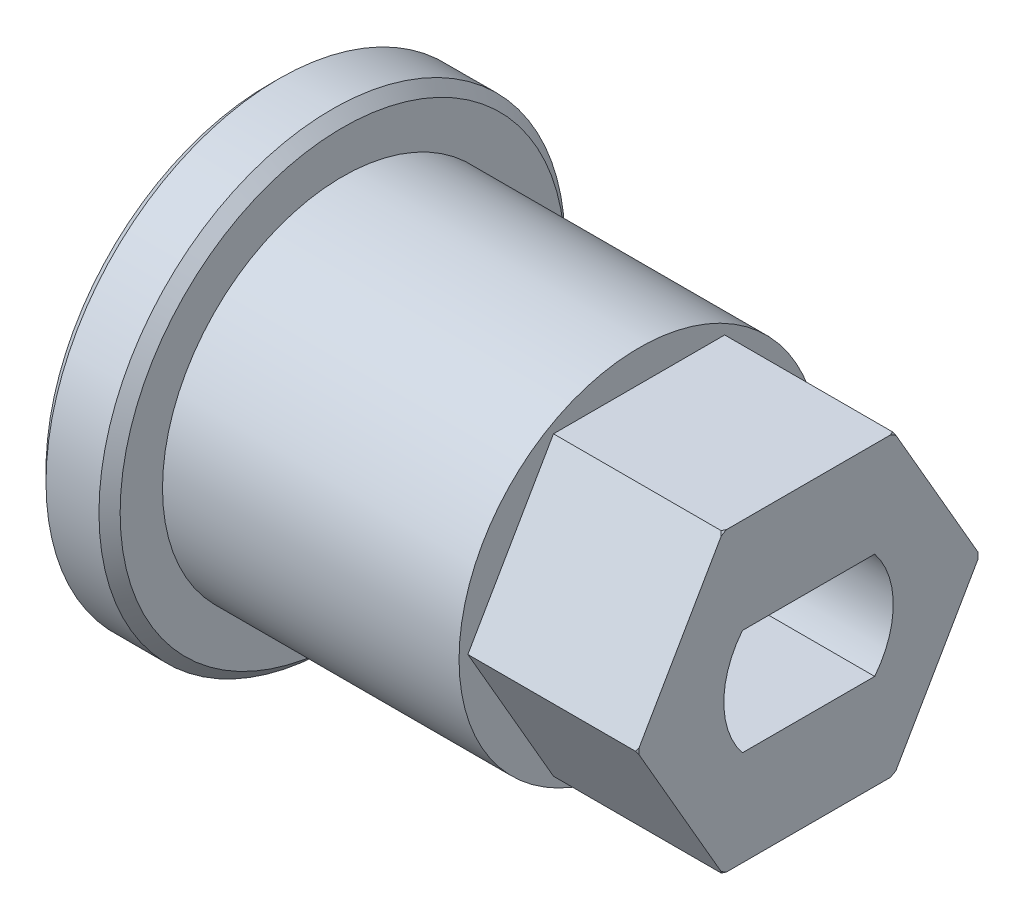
ISO-10303-21;
HEADER;
FILE_DESCRIPTION(('STEP AP214'),'2;1');
FILE_NAME('part.step','',(''),(''),'','','');
FILE_SCHEMA(('AUTOMOTIVE_DESIGN { 1 0 10303 214 1 1 1 1 }'));
ENDSEC;
DATA;
#1=APPLICATION_CONTEXT('core data for automotive mechanical design processes');
#2=APPLICATION_PROTOCOL_DEFINITION('international standard','automotive_design',2000,#1);
#3=PRODUCT_CONTEXT('',#1,'mechanical');
#4=PRODUCT('Part','Part','',(#3));
#5=PRODUCT_RELATED_PRODUCT_CATEGORY('part','',(#4));
#6=PRODUCT_DEFINITION_FORMATION('','',#4);
#7=PRODUCT_DEFINITION_CONTEXT('part definition',#1,'design');
#8=PRODUCT_DEFINITION('design','',#6,#7);
#9=PRODUCT_DEFINITION_SHAPE('','',#8);
#10=(LENGTH_UNIT() NAMED_UNIT(*) SI_UNIT(.MILLI.,.METRE.));
#11=(NAMED_UNIT(*) PLANE_ANGLE_UNIT() SI_UNIT($,.RADIAN.));
#12=(NAMED_UNIT(*) SI_UNIT($,.STERADIAN.) SOLID_ANGLE_UNIT());
#13=UNCERTAINTY_MEASURE_WITH_UNIT(LENGTH_MEASURE(1.E-05),#10,'distance_accuracy_value','');
#14=(GEOMETRIC_REPRESENTATION_CONTEXT(3) GLOBAL_UNCERTAINTY_ASSIGNED_CONTEXT((#13)) GLOBAL_UNIT_ASSIGNED_CONTEXT((#10,
#11,#12)) REPRESENTATION_CONTEXT('',''));
#15=CARTESIAN_POINT('',(0.,0.,0.));
#16=DIRECTION('',(0.,0.,1.));
#17=DIRECTION('',(1.,0.,0.));
#18=AXIS2_PLACEMENT_3D('',#15,#16,#17);
#19=CARTESIAN_POINT('',(0.,0.,0.));
#20=DIRECTION('',(-1.,0.,0.));
#21=DIRECTION('',(0.,0.,1.));
#22=AXIS2_PLACEMENT_3D('',#19,#20,#21);
#23=CYLINDRICAL_SURFACE('',#22,8.5);
#24=CARTESIAN_POINT('',(3.5,0.,0.));
#25=DIRECTION('',(-1.,0.,0.));
#26=DIRECTION('',(0.,0.,1.));
#27=AXIS2_PLACEMENT_3D('',#24,#25,#26);
#28=CIRCLE('',#27,8.5);
#29=CARTESIAN_POINT('',(3.5,0.,8.5));
#30=VERTEX_POINT('',#29);
#31=EDGE_CURVE('E221',#30,#30,#28,.T.);
#32=ORIENTED_EDGE('',*,*,#31,.F.);
#33=EDGE_LOOP('',(#32));
#34=FACE_BOUND('',#33,.T.);
#35=CARTESIAN_POINT('',(17.5,0.,0.));
#36=DIRECTION('',(1.,0.,0.));
#37=DIRECTION('',(0.,0.,-1.));
#38=AXIS2_PLACEMENT_3D('',#35,#36,#37);
#39=CIRCLE('',#38,8.5);
#40=CARTESIAN_POINT('',(17.5,0.,-8.5));
#41=VERTEX_POINT('',#40);
#42=EDGE_CURVE('E37',#41,#41,#39,.T.);
#43=ORIENTED_EDGE('',*,*,#42,.F.);
#44=EDGE_LOOP('',(#43));
#45=FACE_BOUND('',#44,.T.);
#46=ADVANCED_FACE('F33',(#34,#45),#23,.T.);
#47=CARTESIAN_POINT('',(25.5,8.5,0.));
#48=DIRECTION('',(-1.,0.,0.));
#49=DIRECTION('',(0.,0.,1.));
#50=AXIS2_PLACEMENT_3D('',#47,#48,#49);
#51=PLANE('',#50);
#52=DIRECTION('',(0.,0.,-1.));
#53=VECTOR('',#52,1.);
#54=CARTESIAN_POINT('',(25.5,-2.5,3.1224989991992));
#55=LINE('',#54,#53);
#56=CARTESIAN_POINT('',(25.5,-2.5,3.1224989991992));
#57=VERTEX_POINT('',#56);
#58=CARTESIAN_POINT('',(25.5,-2.5,-3.1224989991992));
#59=VERTEX_POINT('',#58);
#60=EDGE_CURVE('E199',#57,#59,#55,.T.);
#61=ORIENTED_EDGE('',*,*,#60,.F.);
#62=CARTESIAN_POINT('',(25.5,0.,0.));
#63=DIRECTION('',(1.,0.,0.));
#64=DIRECTION('',(0.,0.,-1.));
#65=AXIS2_PLACEMENT_3D('',#62,#63,#64);
#66=CIRCLE('',#65,4.);
#67=CARTESIAN_POINT('',(25.5,2.5,3.1224989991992));
#68=VERTEX_POINT('',#67);
#69=EDGE_CURVE('E197',#68,#57,#66,.T.);
#70=ORIENTED_EDGE('',*,*,#69,.F.);
#71=DIRECTION('',(0.,0.,1.));
#72=VECTOR('',#71,1.);
#73=CARTESIAN_POINT('',(25.5,2.5,3.1224989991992));
#74=LINE('',#73,#72);
#75=CARTESIAN_POINT('',(25.5,2.5,-3.1224989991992));
#76=VERTEX_POINT('',#75);
#77=EDGE_CURVE('E205',#76,#68,#74,.T.);
#78=ORIENTED_EDGE('',*,*,#77,.F.);
#79=CARTESIAN_POINT('',(25.5,0.,0.));
#80=DIRECTION('',(1.,0.,0.));
#81=DIRECTION('',(0.,0.,-1.));
#82=AXIS2_PLACEMENT_3D('',#79,#80,#81);
#83=CIRCLE('',#82,4.);
#84=EDGE_CURVE('E202',#59,#76,#83,.T.);
#85=ORIENTED_EDGE('',*,*,#84,.F.);
#86=EDGE_LOOP('',(#61,#70,#78,#85));
#87=FACE_BOUND('',#86,.T.);
#88=DIRECTION('',(0.,0.866025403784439,-0.5));
#89=VECTOR('',#88,1.);
#90=CARTESIAN_POINT('',(25.5,-7.,-4.04145188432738));
#91=LINE('',#90,#89);
#92=CARTESIAN_POINT('',(25.5,-6.85410196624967,-4.12568615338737));
#93=VERTEX_POINT('',#92);
#94=CARTESIAN_POINT('',(25.5,-0.145898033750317,-7.99866949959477));
#95=VERTEX_POINT('',#94);
#96=EDGE_CURVE('E383',#93,#95,#91,.T.);
#97=ORIENTED_EDGE('',*,*,#96,.T.);
#98=CARTESIAN_POINT('',(25.5,0.,0.));
#99=DIRECTION('',(-1.,0.,0.));
#100=DIRECTION('',(0.,0.,1.));
#101=AXIS2_PLACEMENT_3D('',#98,#99,#100);
#102=CIRCLE('',#101,7.99999999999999);
#103=CARTESIAN_POINT('',(25.5,0.145898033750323,-7.99866949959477));
#104=VERTEX_POINT('',#103);
#105=EDGE_CURVE('E362',#95,#104,#102,.F.);
#106=ORIENTED_EDGE('',*,*,#105,.T.);
#107=DIRECTION('',(0.,0.866025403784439,0.5));
#108=VECTOR('',#107,1.);
#109=CARTESIAN_POINT('',(25.5,0.,-8.08290376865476));
#110=LINE('',#109,#108);
#111=CARTESIAN_POINT('',(25.5,6.85410196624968,-4.12568615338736));
#112=VERTEX_POINT('',#111);
#113=EDGE_CURVE('E382',#104,#112,#110,.T.);
#114=ORIENTED_EDGE('',*,*,#113,.T.);
#115=CARTESIAN_POINT('',(25.5,7.,-3.8729833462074));
#116=VERTEX_POINT('',#115);
#117=EDGE_CURVE('E364',#112,#116,#102,.F.);
#118=ORIENTED_EDGE('',*,*,#117,.T.);
#119=DIRECTION('',(0.,0.,1.));
#120=VECTOR('',#119,1.);
#121=CARTESIAN_POINT('',(25.5,7.,-4.04145188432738));
#122=LINE('',#121,#120);
#123=CARTESIAN_POINT('',(25.5,7.,3.8729833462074));
#124=VERTEX_POINT('',#123);
#125=EDGE_CURVE('E375',#116,#124,#122,.T.);
#126=ORIENTED_EDGE('',*,*,#125,.T.);
#127=CARTESIAN_POINT('',(25.5,6.85410196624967,4.12568615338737));
#128=VERTEX_POINT('',#127);
#129=EDGE_CURVE('E233',#124,#128,#102,.F.);
#130=ORIENTED_EDGE('',*,*,#129,.T.);
#131=DIRECTION('',(0.,-0.866025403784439,0.5));
#132=VECTOR('',#131,1.);
#133=CARTESIAN_POINT('',(25.5,7.,4.04145188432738));
#134=LINE('',#133,#132);
#135=CARTESIAN_POINT('',(25.5,0.145898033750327,7.99866949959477));
#136=VERTEX_POINT('',#135);
#137=EDGE_CURVE('E373',#128,#136,#134,.T.);
#138=ORIENTED_EDGE('',*,*,#137,.T.);
#139=CARTESIAN_POINT('',(25.5,-0.14589803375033,7.99866949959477));
#140=VERTEX_POINT('',#139);
#141=EDGE_CURVE('E230',#136,#140,#102,.F.);
#142=ORIENTED_EDGE('',*,*,#141,.T.);
#143=DIRECTION('',(0.,-0.866025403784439,-0.5));
#144=VECTOR('',#143,1.);
#145=CARTESIAN_POINT('',(25.5,0.,8.08290376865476));
#146=LINE('',#145,#144);
#147=CARTESIAN_POINT('',(25.5,-6.85410196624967,4.12568615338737));
#148=VERTEX_POINT('',#147);
#149=EDGE_CURVE('E174',#140,#148,#146,.T.);
#150=ORIENTED_EDGE('',*,*,#149,.T.);
#151=CARTESIAN_POINT('',(25.5,-7.,3.8729833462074));
#152=VERTEX_POINT('',#151);
#153=EDGE_CURVE('E234',#148,#152,#102,.F.);
#154=ORIENTED_EDGE('',*,*,#153,.T.);
#155=DIRECTION('',(0.,0.,-1.));
#156=VECTOR('',#155,1.);
#157=CARTESIAN_POINT('',(25.5,-7.,4.04145188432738));
#158=LINE('',#157,#156);
#159=CARTESIAN_POINT('',(25.5,-7.,-3.8729833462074));
#160=VERTEX_POINT('',#159);
#161=EDGE_CURVE('E171',#152,#160,#158,.T.);
#162=ORIENTED_EDGE('',*,*,#161,.T.);
#163=EDGE_CURVE('E353',#160,#93,#102,.F.);
#164=ORIENTED_EDGE('',*,*,#163,.T.);
#165=EDGE_LOOP('',(#97,#106,#114,#118,#126,#130,#138,#142,#150,#154,#162,#164));
#166=FACE_BOUND('',#165,.T.);
#167=ADVANCED_FACE('F358',(#87,#166),#51,.F.);
#168=CARTESIAN_POINT('',(25.,0.,0.));
#169=DIRECTION('',(-1.,0.,0.));
#170=DIRECTION('',(0.,0.,1.));
#171=AXIS2_PLACEMENT_3D('',#168,#169,#170);
#172=CONICAL_SURFACE('',#171,8.5,0.785398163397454);
#173=CARTESIAN_POINT('',(26.4953331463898,-7.,-0.255651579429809));
#174=CARTESIAN_POINT('',(26.4913094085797,-7.,-0.366254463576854));
#175=CARTESIAN_POINT('',(26.4846476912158,-7.,-0.476753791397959));
#176=CARTESIAN_POINT('',(26.466209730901,-7.,-0.697302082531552));
#177=CARTESIAN_POINT('',(26.4544345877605,-7.,-0.807351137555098));
#178=CARTESIAN_POINT('',(26.4259523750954,-7.,-1.02662605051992));
#179=CARTESIAN_POINT('',(26.4092533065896,-7.,-1.13585295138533));
#180=CARTESIAN_POINT('',(26.371155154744,-7.,-1.35348100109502));
#181=CARTESIAN_POINT('',(26.3497558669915,-7.,-1.46188211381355));
#182=CARTESIAN_POINT('',(26.2794364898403,-7.,-1.78321744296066));
#183=CARTESIAN_POINT('',(26.2240612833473,-7.,-1.99475997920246));
#184=CARTESIAN_POINT('',(26.0983710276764,-7.,-2.41330005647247));
#185=CARTESIAN_POINT('',(26.0280552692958,-7.,-2.62029738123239));
#186=CARTESIAN_POINT('',(25.9251730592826,-7.,-2.89521230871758));
#187=CARTESIAN_POINT('',(25.8981218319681,-7.,-2.9652407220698));
#188=CARTESIAN_POINT('',(25.8425913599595,-7.,-3.10483620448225));
#189=CARTESIAN_POINT('',(25.8141102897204,-7.,-3.17440254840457));
#190=CARTESIAN_POINT('',(25.6453013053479,-7.,-3.57592869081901));
#191=CARTESIAN_POINT('',(25.4906404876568,-7.,-3.90192619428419));
#192=CARTESIAN_POINT('',(25.1596349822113,-7.,-4.54280544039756));
#193=CARTESIAN_POINT('',(24.9832701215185,-7.,-4.85767648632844));
#194=CARTESIAN_POINT('',(24.6139806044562,-7.,-5.47942576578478));
#195=CARTESIAN_POINT('',(24.4209841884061,-7.,-5.78626106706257));
#196=CARTESIAN_POINT('',(24.023365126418,-7.,-6.39208744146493));
#197=CARTESIAN_POINT('',(23.8187464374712,-7.,-6.69108113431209));
#198=CARTESIAN_POINT('',(23.4058243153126,-7.,-7.27558025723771));
#199=CARTESIAN_POINT('',(23.1977335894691,-7.,-7.56123671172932));
#200=CARTESIAN_POINT('',(22.7750502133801,-7.,-8.12773460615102));
#201=CARTESIAN_POINT('',(22.5604567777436,-7.,-8.40857545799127));
#202=CARTESIAN_POINT('',(22.128567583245,-7.,-8.96323031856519));
#203=CARTESIAN_POINT('',(21.9113272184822,-7.,-9.23708760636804));
#204=CARTESIAN_POINT('',(21.47287781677,-7.,-9.78147627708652));
#205=CARTESIAN_POINT('',(21.2516699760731,-7.,-10.0520086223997));
#206=CARTESIAN_POINT('',(21.0289148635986,-7.,-10.3212385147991));
#207=B_SPLINE_CURVE_WITH_KNOTS('',3,(#173,#174,#175,#176,#177,#178,#179,#180,#181,#182,#183,
#184,#185,#186,#187,#188,#189,#190,#191,#192,#193,#194,#195,#196,#197,#198,#199,#200,#201,#202,
#203,#204,#205,#206),.UNSPECIFIED.,.F.,.F.,(4,2,2,2,2,2,2,2,2,2,2,2,2,2,2,2,4),(0.,
0.331985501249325,0.663899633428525,0.995277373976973,1.3266695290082,1.98198161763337,
2.63732481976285,2.86253012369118,3.08803065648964,4.16917769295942,5.25133730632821,
6.33842536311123,7.42514549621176,8.48527200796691,9.54552707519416,10.5941618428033,
11.6424855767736),.UNSPECIFIED.);
#208=CARTESIAN_POINT('',(25.4170962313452,-7.,-4.04145188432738));
#209=VERTEX_POINT('',#208);
#210=EDGE_CURVE('E42',#160,#209,#207,.T.);
#211=ORIENTED_EDGE('',*,*,#210,.T.);
#212=CARTESIAN_POINT('',(25.4169807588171,-7.0002,-4.04133641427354));
#213=CARTESIAN_POINT('',(25.4310314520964,-6.97586775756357,-4.0553846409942));
#214=CARTESIAN_POINT('',(25.4449917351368,-6.95149698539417,-4.06945511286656));
#215=CARTESIAN_POINT('',(25.4727314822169,-6.90267837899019,-4.09764054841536));
#216=CARTESIAN_POINT('',(25.4865109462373,-6.87823054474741,-4.11175551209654));
#217=CARTESIAN_POINT('',(25.5001999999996,-6.85374418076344,-4.12589272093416));
#218=B_SPLINE_CURVE_WITH_KNOTS('',3,(#212,#213,#214,#215,#216,#217),.UNSPECIFIED.,.F.,.F.,(4,2,
4),(0.,0.0942402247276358,0.188480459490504),.UNSPECIFIED.);
#219=EDGE_CURVE('E11',#209,#93,#218,.T.);
#220=ORIENTED_EDGE('',*,*,#219,.T.);
#221=ORIENTED_EDGE('',*,*,#163,.F.);
#222=EDGE_LOOP('',(#211,#220,#221));
#223=FACE_BOUND('',#222,.T.);
#224=ADVANCED_FACE('F263',(#223),#172,.T.);
#225=CARTESIAN_POINT('',(25.5001999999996,-6.85374418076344,4.12589272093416));
#226=CARTESIAN_POINT('',(25.4865109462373,-6.87823054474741,4.11175551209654));
#227=CARTESIAN_POINT('',(25.4727314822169,-6.90267837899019,4.09764054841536));
#228=CARTESIAN_POINT('',(25.4449917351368,-6.95149698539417,4.06945511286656));
#229=CARTESIAN_POINT('',(25.4310314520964,-6.97586775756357,4.0553846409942));
#230=CARTESIAN_POINT('',(25.4169807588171,-7.0002,4.04133641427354));
#231=B_SPLINE_CURVE_WITH_KNOTS('',3,(#225,#226,#227,#228,#229,#230),.UNSPECIFIED.,.F.,.F.,(4,2,
4),(0.,0.0942402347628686,0.188480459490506),.UNSPECIFIED.);
#232=CARTESIAN_POINT('',(25.4170962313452,-7.,4.04145188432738));
#233=VERTEX_POINT('',#232);
#234=EDGE_CURVE('E327',#148,#233,#231,.T.);
#235=ORIENTED_EDGE('',*,*,#234,.T.);
#236=CARTESIAN_POINT('',(21.0289148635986,-7.,10.3212385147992));
#237=CARTESIAN_POINT('',(21.1445806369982,-7.,10.1814771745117));
#238=CARTESIAN_POINT('',(21.2598103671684,-7.,10.0413551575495));
#239=CARTESIAN_POINT('',(21.4892937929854,-7.,9.76031015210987));
#240=CARTESIAN_POINT('',(21.6035474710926,-7.,9.61938714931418));
#241=CARTESIAN_POINT('',(21.9447566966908,-7.,9.19521227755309));
#242=CARTESIAN_POINT('',(22.170084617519,-7.,8.9106458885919));
#243=CARTESIAN_POINT('',(22.6178186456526,-7.,8.33398359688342));
#244=CARTESIAN_POINT('',(22.840161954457,-7.,8.04183881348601));
#245=CARTESIAN_POINT('',(23.277636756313,-7.,7.45223523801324));
#246=CARTESIAN_POINT('',(23.4927692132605,-7.,7.15477716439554));
#247=CARTESIAN_POINT('',(23.9030423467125,-7.,6.56835365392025));
#248=CARTESIAN_POINT('',(24.098644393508,-7.,6.27971248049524));
#249=CARTESIAN_POINT('',(24.4787075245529,-7.,5.69500932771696));
#250=CARTESIAN_POINT('',(24.6631654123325,-7.,5.39894525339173));
#251=CARTESIAN_POINT('',(25.0162917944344,-7.,4.79915277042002));
#252=CARTESIAN_POINT('',(25.1850232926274,-7.,4.49546173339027));
#253=CARTESIAN_POINT('',(25.5021152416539,-7.,3.87767682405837));
#254=CARTESIAN_POINT('',(25.6504911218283,-7.,3.56359105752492));
#255=CARTESIAN_POINT('',(25.8344137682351,-7.,3.12610655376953));
#256=CARTESIAN_POINT('',(25.8819733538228,-7.,3.0077306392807));
#257=CARTESIAN_POINT('',(25.9728930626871,-7.,2.76938553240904));
#258=CARTESIAN_POINT('',(26.0162532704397,-7.,2.64941637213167));
#259=CARTESIAN_POINT('',(26.1392888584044,-7.,2.28725458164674));
#260=CARTESIAN_POINT('',(26.2120069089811,-7.,2.04260287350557));
#261=CARTESIAN_POINT('',(26.3047182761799,-7.,1.66941558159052));
#262=CARTESIAN_POINT('',(26.3330587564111,-7.,1.54291250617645));
#263=CARTESIAN_POINT('',(26.383461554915,-7.,1.28865808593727));
#264=CARTESIAN_POINT('',(26.4055244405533,-7.,1.16090685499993));
#265=CARTESIAN_POINT('',(26.4430226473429,-7.,0.903946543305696));
#266=CARTESIAN_POINT('',(26.4584330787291,-7.,0.774733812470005));
#267=CARTESIAN_POINT('',(26.4822284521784,-7.,0.515614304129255));
#268=CARTESIAN_POINT('',(26.4906106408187,-7.,0.385707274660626));
#269=CARTESIAN_POINT('',(26.4953331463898,-7.,0.255651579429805));
#270=B_SPLINE_CURVE_WITH_KNOTS('',3,(#236,#237,#238,#239,#240,#241,#242,#243,#244,#245,#246,
#247,#248,#249,#250,#251,#252,#253,#254,#255,#256,#257,#258,#259,#260,#261,#262,#263,#264,#265,
#266,#267,#268,#269),.UNSPECIFIED.,.F.,.F.,(4,2,2,2,2,2,2,2,2,2,2,2,2,2,2,2,4),(0.,
0.544246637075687,1.08850303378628,2.17737192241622,3.27868175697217,4.37984378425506,
5.42567662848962,6.47180803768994,7.51354993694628,8.55449779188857,8.93714490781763,
9.31978432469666,10.0843963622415,10.4731860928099,10.8619406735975,11.252137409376,
11.642486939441),.UNSPECIFIED.);
#271=EDGE_CURVE('E334',#233,#152,#270,.T.);
#272=ORIENTED_EDGE('',*,*,#271,.T.);
#273=ORIENTED_EDGE('',*,*,#153,.F.);
#274=EDGE_LOOP('',(#235,#272,#273));
#275=FACE_BOUND('',#274,.T.);
#276=ADVANCED_FACE('F519',(#275),#172,.T.);
#277=CARTESIAN_POINT('',(25.5002,0.146255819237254,7.99846293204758));
#278=CARTESIAN_POINT('',(25.4865109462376,0.121769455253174,8.01260014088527));
#279=CARTESIAN_POINT('',(25.4727314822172,0.0973216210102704,8.02671510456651));
#280=CARTESIAN_POINT('',(25.4449917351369,0.0485030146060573,8.05490054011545));
#281=CARTESIAN_POINT('',(25.4310314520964,0.0241322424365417,8.06897101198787));
#282=CARTESIAN_POINT('',(25.4169807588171,-0.00020000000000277,8.0830192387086));
#283=B_SPLINE_CURVE_WITH_KNOTS('',3,(#277,#278,#279,#280,#281,#282),.UNSPECIFIED.,.F.,.F.,(4,2,
4),(0.,0.0942402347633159,0.188480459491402),.UNSPECIFIED.);
#284=CARTESIAN_POINT('',(25.4170962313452,0.,8.08290376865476));
#285=VERTEX_POINT('',#284);
#286=EDGE_CURVE('E301',#136,#285,#283,.T.);
#287=ORIENTED_EDGE('',*,*,#286,.T.);
#288=CARTESIAN_POINT('',(25.4169807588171,0.000199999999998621,8.0830192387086));
#289=CARTESIAN_POINT('',(25.4310314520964,-0.0241322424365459,8.06897101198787));
#290=CARTESIAN_POINT('',(25.4449917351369,-0.0485030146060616,8.05490054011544));
#291=CARTESIAN_POINT('',(25.4727314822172,-0.0973216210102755,8.02671510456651));
#292=CARTESIAN_POINT('',(25.4865109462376,-0.121769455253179,8.01260014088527));
#293=CARTESIAN_POINT('',(25.5002,-0.14625581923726,7.99846293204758));
#294=B_SPLINE_CURVE_WITH_KNOTS('',3,(#288,#289,#290,#291,#292,#293),.UNSPECIFIED.,.F.,.F.,(4,2,
4),(0.,0.0942402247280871,0.188480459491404),.UNSPECIFIED.);
#295=EDGE_CURVE('E321',#285,#140,#294,.T.);
#296=ORIENTED_EDGE('',*,*,#295,.T.);
#297=ORIENTED_EDGE('',*,*,#141,.F.);
#298=EDGE_LOOP('',(#287,#296,#297));
#299=FACE_BOUND('',#298,.T.);
#300=ADVANCED_FACE('F395',(#299),#172,.T.);
#301=CARTESIAN_POINT('',(26.4953331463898,7.,0.255651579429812));
#302=CARTESIAN_POINT('',(26.4913094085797,7.,0.366254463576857));
#303=CARTESIAN_POINT('',(26.4846476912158,7.,0.476753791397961));
#304=CARTESIAN_POINT('',(26.466209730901,7.,0.697302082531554));
#305=CARTESIAN_POINT('',(26.4544345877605,7.,0.807351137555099));
#306=CARTESIAN_POINT('',(26.4259523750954,7.,1.02662605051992));
#307=CARTESIAN_POINT('',(26.4092533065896,7.,1.13585295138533));
#308=CARTESIAN_POINT('',(26.371155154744,7.,1.35348100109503));
#309=CARTESIAN_POINT('',(26.3497558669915,7.,1.46188211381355));
#310=CARTESIAN_POINT('',(26.2794364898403,7.,1.78321744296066));
#311=CARTESIAN_POINT('',(26.2240612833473,7.,1.99475997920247));
#312=CARTESIAN_POINT('',(26.0983710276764,7.,2.41330005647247));
#313=CARTESIAN_POINT('',(26.0280552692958,7.,2.62029738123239));
#314=CARTESIAN_POINT('',(25.9251730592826,7.,2.89521230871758));
#315=CARTESIAN_POINT('',(25.8981218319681,7.,2.9652407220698));
#316=CARTESIAN_POINT('',(25.8425913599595,7.,3.10483620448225));
#317=CARTESIAN_POINT('',(25.8141102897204,7.,3.17440254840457));
#318=CARTESIAN_POINT('',(25.6453013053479,7.,3.57592869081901));
#319=CARTESIAN_POINT('',(25.4906404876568,7.,3.90192619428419));
#320=CARTESIAN_POINT('',(25.1596349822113,7.,4.54280544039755));
#321=CARTESIAN_POINT('',(24.9832701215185,7.,4.85767648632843));
#322=CARTESIAN_POINT('',(24.6139806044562,7.,5.47942576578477));
#323=CARTESIAN_POINT('',(24.4209841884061,7.,5.78626106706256));
#324=CARTESIAN_POINT('',(24.023365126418,7.,6.39208744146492));
#325=CARTESIAN_POINT('',(23.8187464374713,7.,6.69108113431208));
#326=CARTESIAN_POINT('',(23.4058243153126,7.,7.27558025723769));
#327=CARTESIAN_POINT('',(23.1977335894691,7.,7.56123671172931));
#328=CARTESIAN_POINT('',(22.7750502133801,7.,8.12773460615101));
#329=CARTESIAN_POINT('',(22.5604567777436,7.,8.40857545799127));
#330=CARTESIAN_POINT('',(22.128567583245,7.,8.96323031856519));
#331=CARTESIAN_POINT('',(21.9113272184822,7.,9.23708760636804));
#332=CARTESIAN_POINT('',(21.47287781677,7.,9.78147627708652));
#333=CARTESIAN_POINT('',(21.2516699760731,7.,10.0520086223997));
#334=CARTESIAN_POINT('',(21.0289148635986,7.,10.3212385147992));
#335=B_SPLINE_CURVE_WITH_KNOTS('',3,(#301,#302,#303,#304,#305,#306,#307,#308,#309,#310,#311,
#312,#313,#314,#315,#316,#317,#318,#319,#320,#321,#322,#323,#324,#325,#326,#327,#328,#329,#330,
#331,#332,#333,#334),.UNSPECIFIED.,.F.,.F.,(4,2,2,2,2,2,2,2,2,2,2,2,2,2,2,2,4),(0.,
0.331985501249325,0.663899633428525,0.995277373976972,1.3266695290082,1.98198161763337,
2.63732481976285,2.86253012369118,3.08803065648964,4.16917769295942,5.2513373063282,
6.33842536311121,7.42514549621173,8.4852720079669,9.54552707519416,10.5941618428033,
11.6424855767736),.UNSPECIFIED.);
#336=CARTESIAN_POINT('',(25.4170962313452,7.,4.04145188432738));
#337=VERTEX_POINT('',#336);
#338=EDGE_CURVE('E287',#124,#337,#335,.T.);
#339=ORIENTED_EDGE('',*,*,#338,.T.);
#340=CARTESIAN_POINT('',(25.4169807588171,7.0002,4.04133641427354));
#341=CARTESIAN_POINT('',(25.4310314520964,6.97586775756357,4.0553846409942));
#342=CARTESIAN_POINT('',(25.4449917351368,6.95149698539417,4.06945511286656));
#343=CARTESIAN_POINT('',(25.4727314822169,6.90267837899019,4.09764054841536));
#344=CARTESIAN_POINT('',(25.4865109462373,6.87823054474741,4.11175551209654));
#345=CARTESIAN_POINT('',(25.5001999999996,6.85374418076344,4.12589272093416));
#346=B_SPLINE_CURVE_WITH_KNOTS('',3,(#340,#341,#342,#343,#344,#345),.UNSPECIFIED.,.F.,.F.,(4,2,
4),(0.,0.0942402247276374,0.188480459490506),.UNSPECIFIED.);
#347=EDGE_CURVE('E294',#337,#128,#346,.T.);
#348=ORIENTED_EDGE('',*,*,#347,.T.);
#349=ORIENTED_EDGE('',*,*,#129,.F.);
#350=EDGE_LOOP('',(#339,#348,#349));
#351=FACE_BOUND('',#350,.T.);
#352=ADVANCED_FACE('F377',(#351),#172,.T.);
#353=ORIENTED_EDGE('',*,*,#105,.F.);
#354=CARTESIAN_POINT('',(25.5002,-0.14625581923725,-7.99846293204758));
#355=CARTESIAN_POINT('',(25.4865109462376,-0.12176945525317,-8.01260014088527));
#356=CARTESIAN_POINT('',(25.4727314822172,-0.0973216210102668,-8.02671510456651));
#357=CARTESIAN_POINT('',(25.4449917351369,-0.0485030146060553,-8.05490054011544));
#358=CARTESIAN_POINT('',(25.4310314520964,-0.024132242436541,-8.06897101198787));
#359=CARTESIAN_POINT('',(25.4169807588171,0.000200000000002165,-8.0830192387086));
#360=B_SPLINE_CURVE_WITH_KNOTS('',3,(#354,#355,#356,#357,#358,#359),.UNSPECIFIED.,.F.,.F.,(4,2,
4),(0.,0.0942402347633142,0.188480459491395),.UNSPECIFIED.);
#361=CARTESIAN_POINT('',(25.4170962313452,0.,-8.08290376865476));
#362=VERTEX_POINT('',#361);
#363=EDGE_CURVE('E281',#95,#362,#360,.T.);
#364=ORIENTED_EDGE('',*,*,#363,.T.);
#365=CARTESIAN_POINT('',(25.4169807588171,-0.000199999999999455,-8.0830192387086));
#366=CARTESIAN_POINT('',(25.4310314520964,0.0241322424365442,-8.06897101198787));
#367=CARTESIAN_POINT('',(25.4449917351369,0.0485030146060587,-8.05490054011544));
#368=CARTESIAN_POINT('',(25.4727314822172,0.0973216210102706,-8.02671510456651));
#369=CARTESIAN_POINT('',(25.4865109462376,0.121769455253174,-8.01260014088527));
#370=CARTESIAN_POINT('',(25.5002,0.146255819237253,-7.99846293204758));
#371=B_SPLINE_CURVE_WITH_KNOTS('',3,(#365,#366,#367,#368,#369,#370),.UNSPECIFIED.,.F.,.F.,(4,2,
4),(0.,0.0942402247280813,0.188480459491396),.UNSPECIFIED.);
#372=EDGE_CURVE('E151',#362,#104,#371,.T.);
#373=ORIENTED_EDGE('',*,*,#372,.T.);
#374=EDGE_LOOP('',(#353,#364,#373));
#375=FACE_BOUND('',#374,.T.);
#376=ADVANCED_FACE('F389',(#375),#172,.T.);
#377=CARTESIAN_POINT('',(25.5001999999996,6.85374418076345,-4.12589272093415));
#378=CARTESIAN_POINT('',(25.4865109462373,6.87823054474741,-4.11175551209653));
#379=CARTESIAN_POINT('',(25.4727314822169,6.90267837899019,-4.09764054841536));
#380=CARTESIAN_POINT('',(25.4449917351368,6.95149698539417,-4.06945511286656));
#381=CARTESIAN_POINT('',(25.4310314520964,6.97586775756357,-4.0553846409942));
#382=CARTESIAN_POINT('',(25.4169807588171,7.0002,-4.04133641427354));
#383=B_SPLINE_CURVE_WITH_KNOTS('',3,(#377,#378,#379,#380,#381,#382),.UNSPECIFIED.,.F.,.F.,(4,2,
4),(0.,0.0942402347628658,0.188480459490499),.UNSPECIFIED.);
#384=CARTESIAN_POINT('',(25.4170962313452,7.,-4.04145188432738));
#385=VERTEX_POINT('',#384);
#386=EDGE_CURVE('E247',#112,#385,#383,.T.);
#387=ORIENTED_EDGE('',*,*,#386,.T.);
#388=CARTESIAN_POINT('',(21.0289148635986,7.,-10.3212385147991));
#389=CARTESIAN_POINT('',(21.1445806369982,7.,-10.1814771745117));
#390=CARTESIAN_POINT('',(21.2598103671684,7.,-10.0413551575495));
#391=CARTESIAN_POINT('',(21.4892937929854,7.,-9.76031015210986));
#392=CARTESIAN_POINT('',(21.6035474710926,7.,-9.61938714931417));
#393=CARTESIAN_POINT('',(21.9447566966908,7.,-9.19521227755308));
#394=CARTESIAN_POINT('',(22.170084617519,7.,-8.91064588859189));
#395=CARTESIAN_POINT('',(22.6178186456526,7.,-8.33398359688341));
#396=CARTESIAN_POINT('',(22.840161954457,7.,-8.041838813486));
#397=CARTESIAN_POINT('',(23.277636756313,7.,-7.45223523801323));
#398=CARTESIAN_POINT('',(23.4927692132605,7.,-7.15477716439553));
#399=CARTESIAN_POINT('',(23.9030423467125,7.,-6.56835365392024));
#400=CARTESIAN_POINT('',(24.098644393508,7.,-6.27971248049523));
#401=CARTESIAN_POINT('',(24.4787075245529,7.,-5.69500932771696));
#402=CARTESIAN_POINT('',(24.6631654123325,7.,-5.39894525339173));
#403=CARTESIAN_POINT('',(25.0162917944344,7.,-4.79915277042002));
#404=CARTESIAN_POINT('',(25.1850232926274,7.,-4.49546173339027));
#405=CARTESIAN_POINT('',(25.5021152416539,7.,-3.87767682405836));
#406=CARTESIAN_POINT('',(25.6504911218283,7.,-3.56359105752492));
#407=CARTESIAN_POINT('',(25.8344137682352,7.,-3.12610655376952));
#408=CARTESIAN_POINT('',(25.8819733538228,7.,-3.0077306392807));
#409=CARTESIAN_POINT('',(25.9728930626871,7.,-2.76938553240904));
#410=CARTESIAN_POINT('',(26.0162532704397,7.,-2.64941637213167));
#411=CARTESIAN_POINT('',(26.1392888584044,7.,-2.28725458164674));
#412=CARTESIAN_POINT('',(26.2120069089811,7.,-2.04260287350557));
#413=CARTESIAN_POINT('',(26.3047182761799,7.,-1.66941558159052));
#414=CARTESIAN_POINT('',(26.3330587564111,7.,-1.54291250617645));
#415=CARTESIAN_POINT('',(26.383461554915,7.,-1.28865808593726));
#416=CARTESIAN_POINT('',(26.4055244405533,7.,-1.16090685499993));
#417=CARTESIAN_POINT('',(26.4430226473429,7.,-0.903946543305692));
#418=CARTESIAN_POINT('',(26.4584330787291,7.,-0.774733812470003));
#419=CARTESIAN_POINT('',(26.4822284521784,7.,-0.515614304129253));
#420=CARTESIAN_POINT('',(26.4906106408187,7.,-0.385707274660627));
#421=CARTESIAN_POINT('',(26.4953331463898,7.,-0.255651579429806));
#422=B_SPLINE_CURVE_WITH_KNOTS('',3,(#388,#389,#390,#391,#392,#393,#394,#395,#396,#397,#398,
#399,#400,#401,#402,#403,#404,#405,#406,#407,#408,#409,#410,#411,#412,#413,#414,#415,#416,#417,
#418,#419,#420,#421),.UNSPECIFIED.,.F.,.F.,(4,2,2,2,2,2,2,2,2,2,2,2,2,2,2,2,4),(0.,
0.544246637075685,1.08850303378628,2.17737192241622,3.27868175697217,4.37984378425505,
5.42567662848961,6.47180803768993,7.51354993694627,8.55449779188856,8.93714490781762,
9.31978432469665,10.0843963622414,10.4731860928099,10.8619406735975,11.252137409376,
11.642486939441),.UNSPECIFIED.);
#423=EDGE_CURVE('E256',#385,#116,#422,.T.);
#424=ORIENTED_EDGE('',*,*,#423,.T.);
#425=ORIENTED_EDGE('',*,*,#117,.F.);
#426=EDGE_LOOP('',(#387,#424,#425));
#427=FACE_BOUND('',#426,.T.);
#428=ADVANCED_FACE('F381',(#427),#172,.T.);
#429=CARTESIAN_POINT('',(0.,0.,0.));
#430=DIRECTION('',(1.,0.,0.));
#431=DIRECTION('',(0.,0.,-1.));
#432=AXIS2_PLACEMENT_3D('',#429,#430,#431);
#433=PLANE('',#432);
#434=CARTESIAN_POINT('',(0.,0.,0.));
#435=DIRECTION('',(1.,0.,0.));
#436=DIRECTION('',(0.,0.,-1.));
#437=AXIS2_PLACEMENT_3D('',#434,#435,#436);
#438=CIRCLE('',#437,10.5);
#439=CARTESIAN_POINT('',(0.,0.,-10.5));
#440=VERTEX_POINT('',#439);
#441=EDGE_CURVE('E244',#440,#440,#438,.F.);
#442=ORIENTED_EDGE('',*,*,#441,.T.);
#443=EDGE_LOOP('',(#442));
#444=FACE_BOUND('',#443,.T.);
#445=DIRECTION('',(0.,0.,1.));
#446=VECTOR('',#445,1.);
#447=CARTESIAN_POINT('',(0.,2.5,3.1224989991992));
#448=LINE('',#447,#446);
#449=CARTESIAN_POINT('',(0.,2.5,-3.1224989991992));
#450=VERTEX_POINT('',#449);
#451=CARTESIAN_POINT('',(0.,2.5,3.1224989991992));
#452=VERTEX_POINT('',#451);
#453=EDGE_CURVE('E215',#450,#452,#448,.T.);
#454=ORIENTED_EDGE('',*,*,#453,.T.);
#455=CARTESIAN_POINT('',(0.,0.,0.));
#456=DIRECTION('',(1.,0.,0.));
#457=DIRECTION('',(0.,0.,-1.));
#458=AXIS2_PLACEMENT_3D('',#455,#456,#457);
#459=CIRCLE('',#458,4.);
#460=CARTESIAN_POINT('',(0.,-2.5,3.1224989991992));
#461=VERTEX_POINT('',#460);
#462=EDGE_CURVE('E208',#452,#461,#459,.T.);
#463=ORIENTED_EDGE('',*,*,#462,.T.);
#464=DIRECTION('',(0.,0.,-1.));
#465=VECTOR('',#464,1.);
#466=CARTESIAN_POINT('',(0.,-2.5,3.1224989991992));
#467=LINE('',#466,#465);
#468=CARTESIAN_POINT('',(0.,-2.5,-3.1224989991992));
#469=VERTEX_POINT('',#468);
#470=EDGE_CURVE('E211',#461,#469,#467,.T.);
#471=ORIENTED_EDGE('',*,*,#470,.T.);
#472=CARTESIAN_POINT('',(0.,0.,0.));
#473=DIRECTION('',(1.,0.,0.));
#474=DIRECTION('',(0.,0.,-1.));
#475=AXIS2_PLACEMENT_3D('',#472,#473,#474);
#476=CIRCLE('',#475,4.);
#477=EDGE_CURVE('E57',#469,#450,#476,.T.);
#478=ORIENTED_EDGE('',*,*,#477,.T.);
#479=EDGE_LOOP('',(#454,#463,#471,#478));
#480=FACE_BOUND('',#479,.T.);
#481=ADVANCED_FACE('F35',(#444,#480),#433,.F.);
#482=CARTESIAN_POINT('',(0.,0.,0.));
#483=DIRECTION('',(-1.,0.,0.));
#484=DIRECTION('',(0.,0.,1.));
#485=AXIS2_PLACEMENT_3D('',#482,#483,#484);
#486=CYLINDRICAL_SURFACE('',#485,11.);
#487=CARTESIAN_POINT('',(3.,0.,0.));
#488=DIRECTION('',(-1.,0.,0.));
#489=DIRECTION('',(0.,0.,1.));
#490=AXIS2_PLACEMENT_3D('',#487,#488,#489);
#491=CIRCLE('',#490,11.);
#492=CARTESIAN_POINT('',(3.,0.,11.));
#493=VERTEX_POINT('',#492);
#494=EDGE_CURVE('E238',#493,#493,#491,.T.);
#495=ORIENTED_EDGE('',*,*,#494,.T.);
#496=EDGE_LOOP('',(#495));
#497=FACE_BOUND('',#496,.T.);
#498=CARTESIAN_POINT('',(0.5,0.,0.));
#499=DIRECTION('',(1.,0.,0.));
#500=DIRECTION('',(0.,0.,-1.));
#501=AXIS2_PLACEMENT_3D('',#498,#499,#500);
#502=CIRCLE('',#501,11.);
#503=CARTESIAN_POINT('',(0.5,0.,-11.));
#504=VERTEX_POINT('',#503);
#505=EDGE_CURVE('E235',#504,#504,#502,.T.);
#506=ORIENTED_EDGE('',*,*,#505,.T.);
#507=EDGE_LOOP('',(#506));
#508=FACE_BOUND('',#507,.T.);
#509=ADVANCED_FACE('F411',(#497,#508),#486,.T.);
#510=CARTESIAN_POINT('',(3.5,11.,0.));
#511=DIRECTION('',(-1.,0.,0.));
#512=DIRECTION('',(0.,0.,1.));
#513=AXIS2_PLACEMENT_3D('',#510,#511,#512);
#514=PLANE('',#513);
#515=CARTESIAN_POINT('',(3.5,0.,0.));
#516=DIRECTION('',(-1.,0.,0.));
#517=DIRECTION('',(0.,0.,1.));
#518=AXIS2_PLACEMENT_3D('',#515,#516,#517);
#519=CIRCLE('',#518,10.5);
#520=CARTESIAN_POINT('',(3.5,0.,10.5));
#521=VERTEX_POINT('',#520);
#522=EDGE_CURVE('E241',#521,#521,#519,.F.);
#523=ORIENTED_EDGE('',*,*,#522,.T.);
#524=EDGE_LOOP('',(#523));
#525=FACE_BOUND('',#524,.T.);
#526=ORIENTED_EDGE('',*,*,#31,.T.);
#527=EDGE_LOOP('',(#526));
#528=FACE_BOUND('',#527,.T.);
#529=ADVANCED_FACE('F408',(#525,#528),#514,.F.);
#530=CARTESIAN_POINT('',(0.,0.,0.));
#531=DIRECTION('',(1.,0.,0.));
#532=DIRECTION('',(0.,0.,-1.));
#533=AXIS2_PLACEMENT_3D('',#530,#531,#532);
#534=CYLINDRICAL_SURFACE('',#533,4.);
#535=ORIENTED_EDGE('',*,*,#69,.T.);
#536=DIRECTION('',(1.,0.,0.));
#537=VECTOR('',#536,1.);
#538=CARTESIAN_POINT('',(0.,-2.5,3.1224989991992));
#539=LINE('',#538,#537);
#540=EDGE_CURVE('E218',#461,#57,#539,.T.);
#541=ORIENTED_EDGE('',*,*,#540,.F.);
#542=ORIENTED_EDGE('',*,*,#462,.F.);
#543=DIRECTION('',(1.,0.,0.));
#544=VECTOR('',#543,1.);
#545=CARTESIAN_POINT('',(0.,2.5,3.1224989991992));
#546=LINE('',#545,#544);
#547=EDGE_CURVE('E219',#452,#68,#546,.T.);
#548=ORIENTED_EDGE('',*,*,#547,.T.);
#549=EDGE_LOOP('',(#535,#541,#542,#548));
#550=FACE_BOUND('',#549,.T.);
#551=ADVANCED_FACE('F410',(#550),#534,.F.);
#552=CARTESIAN_POINT('',(0.,2.5,3.1224989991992));
#553=DIRECTION('',(0.,1.,0.));
#554=DIRECTION('',(0.,0.,1.));
#555=AXIS2_PLACEMENT_3D('',#552,#553,#554);
#556=PLANE('',#555);
#557=ORIENTED_EDGE('',*,*,#77,.T.);
#558=ORIENTED_EDGE('',*,*,#547,.F.);
#559=ORIENTED_EDGE('',*,*,#453,.F.);
#560=DIRECTION('',(1.,0.,0.));
#561=VECTOR('',#560,1.);
#562=CARTESIAN_POINT('',(0.,2.5,-3.1224989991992));
#563=LINE('',#562,#561);
#564=EDGE_CURVE('E222',#450,#76,#563,.T.);
#565=ORIENTED_EDGE('',*,*,#564,.T.);
#566=EDGE_LOOP('',(#557,#558,#559,#565));
#567=FACE_BOUND('',#566,.T.);
#568=ADVANCED_FACE('F433',(#567),#556,.F.);
#569=CARTESIAN_POINT('',(0.,0.,0.));
#570=DIRECTION('',(1.,0.,0.));
#571=DIRECTION('',(0.,0.,-1.));
#572=AXIS2_PLACEMENT_3D('',#569,#570,#571);
#573=CYLINDRICAL_SURFACE('',#572,4.);
#574=ORIENTED_EDGE('',*,*,#84,.T.);
#575=ORIENTED_EDGE('',*,*,#564,.F.);
#576=ORIENTED_EDGE('',*,*,#477,.F.);
#577=DIRECTION('',(1.,0.,0.));
#578=VECTOR('',#577,1.);
#579=CARTESIAN_POINT('',(0.,-2.5,-3.1224989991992));
#580=LINE('',#579,#578);
#581=EDGE_CURVE('E224',#469,#59,#580,.T.);
#582=ORIENTED_EDGE('',*,*,#581,.T.);
#583=EDGE_LOOP('',(#574,#575,#576,#582));
#584=FACE_BOUND('',#583,.T.);
#585=ADVANCED_FACE('F442',(#584),#573,.F.);
#586=CARTESIAN_POINT('',(0.,-2.5,3.1224989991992));
#587=DIRECTION('',(0.,-1.,0.));
#588=DIRECTION('',(0.,0.,-1.));
#589=AXIS2_PLACEMENT_3D('',#586,#587,#588);
#590=PLANE('',#589);
#591=ORIENTED_EDGE('',*,*,#60,.T.);
#592=ORIENTED_EDGE('',*,*,#581,.F.);
#593=ORIENTED_EDGE('',*,*,#470,.F.);
#594=ORIENTED_EDGE('',*,*,#540,.T.);
#595=EDGE_LOOP('',(#591,#592,#593,#594));
#596=FACE_BOUND('',#595,.T.);
#597=ADVANCED_FACE('F440',(#596),#590,.F.);
#598=CARTESIAN_POINT('',(3.,0.,0.));
#599=DIRECTION('',(-1.,0.,0.));
#600=DIRECTION('',(0.,0.,1.));
#601=AXIS2_PLACEMENT_3D('',#598,#599,#600);
#602=CONICAL_SURFACE('',#601,11.,0.785398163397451);
#603=ORIENTED_EDGE('',*,*,#522,.F.);
#604=EDGE_LOOP('',(#603));
#605=FACE_BOUND('',#604,.T.);
#606=ORIENTED_EDGE('',*,*,#494,.F.);
#607=EDGE_LOOP('',(#606));
#608=FACE_BOUND('',#607,.T.);
#609=ADVANCED_FACE('F426',(#605,#608),#602,.T.);
#610=CARTESIAN_POINT('',(0.,0.,0.));
#611=DIRECTION('',(1.,0.,0.));
#612=DIRECTION('',(0.,0.,-1.));
#613=AXIS2_PLACEMENT_3D('',#610,#611,#612);
#614=CONICAL_SURFACE('',#613,10.5,0.785398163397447);
#615=ORIENTED_EDGE('',*,*,#505,.F.);
#616=EDGE_LOOP('',(#615));
#617=FACE_BOUND('',#616,.T.);
#618=ORIENTED_EDGE('',*,*,#441,.F.);
#619=EDGE_LOOP('',(#618));
#620=FACE_BOUND('',#619,.T.);
#621=ADVANCED_FACE('F423',(#617,#620),#614,.T.);
#622=CARTESIAN_POINT('',(17.5,0.,0.));
#623=DIRECTION('',(1.,0.,0.));
#624=DIRECTION('',(0.,0.,-1.));
#625=AXIS2_PLACEMENT_3D('',#622,#623,#624);
#626=PLANE('',#625);
#627=DIRECTION('',(0.,0.,-1.));
#628=VECTOR('',#627,1.);
#629=CARTESIAN_POINT('',(17.5,-7.,4.04145188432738));
#630=LINE('',#629,#628);
#631=CARTESIAN_POINT('',(17.5,-7.,4.04145188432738));
#632=VERTEX_POINT('',#631);
#633=CARTESIAN_POINT('',(17.5,-7.,-4.04145188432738));
#634=VERTEX_POINT('',#633);
#635=EDGE_CURVE('E155',#632,#634,#630,.T.);
#636=ORIENTED_EDGE('',*,*,#635,.F.);
#637=DIRECTION('',(0.,-0.866025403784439,-0.5));
#638=VECTOR('',#637,1.);
#639=CARTESIAN_POINT('',(17.5,0.,8.08290376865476));
#640=LINE('',#639,#638);
#641=CARTESIAN_POINT('',(17.5,0.,8.08290376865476));
#642=VERTEX_POINT('',#641);
#643=EDGE_CURVE('E182',#642,#632,#640,.T.);
#644=ORIENTED_EDGE('',*,*,#643,.F.);
#645=DIRECTION('',(0.,-0.866025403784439,0.5));
#646=VECTOR('',#645,1.);
#647=CARTESIAN_POINT('',(17.5,7.,4.04145188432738));
#648=LINE('',#647,#646);
#649=CARTESIAN_POINT('',(17.5,7.,4.04145188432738));
#650=VERTEX_POINT('',#649);
#651=EDGE_CURVE('E179',#650,#642,#648,.T.);
#652=ORIENTED_EDGE('',*,*,#651,.F.);
#653=DIRECTION('',(0.,0.,1.));
#654=VECTOR('',#653,1.);
#655=CARTESIAN_POINT('',(17.5,7.,-4.04145188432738));
#656=LINE('',#655,#654);
#657=CARTESIAN_POINT('',(17.5,7.,-4.04145188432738));
#658=VERTEX_POINT('',#657);
#659=EDGE_CURVE('E166',#658,#650,#656,.T.);
#660=ORIENTED_EDGE('',*,*,#659,.F.);
#661=DIRECTION('',(0.,0.866025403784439,0.5));
#662=VECTOR('',#661,1.);
#663=CARTESIAN_POINT('',(17.5,0.,-8.08290376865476));
#664=LINE('',#663,#662);
#665=CARTESIAN_POINT('',(17.5,0.,-8.08290376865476));
#666=VERTEX_POINT('',#665);
#667=EDGE_CURVE('E149',#666,#658,#664,.T.);
#668=ORIENTED_EDGE('',*,*,#667,.F.);
#669=DIRECTION('',(0.,0.866025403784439,-0.5));
#670=VECTOR('',#669,1.);
#671=CARTESIAN_POINT('',(17.5,-7.,-4.04145188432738));
#672=LINE('',#671,#670);
#673=EDGE_CURVE('E162',#634,#666,#672,.T.);
#674=ORIENTED_EDGE('',*,*,#673,.F.);
#675=EDGE_LOOP('',(#636,#644,#652,#660,#668,#674));
#676=FACE_BOUND('',#675,.T.);
#677=ORIENTED_EDGE('',*,*,#42,.T.);
#678=EDGE_LOOP('',(#677));
#679=FACE_BOUND('',#678,.T.);
#680=ADVANCED_FACE('F160',(#676,#679),#626,.T.);
#681=CARTESIAN_POINT('',(17.5,-7.,-4.04145188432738));
#682=DIRECTION('',(0.,-0.5,-0.866025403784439));
#683=DIRECTION('',(0.,0.866025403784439,-0.5));
#684=AXIS2_PLACEMENT_3D('',#681,#682,#683);
#685=PLANE('',#684);
#686=DIRECTION('',(1.,0.,0.));
#687=VECTOR('',#686,1.);
#688=CARTESIAN_POINT('',(17.5,-7.,-4.04145188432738));
#689=LINE('',#688,#687);
#690=EDGE_CURVE('E170',#634,#209,#689,.T.);
#691=ORIENTED_EDGE('',*,*,#690,.F.);
#692=ORIENTED_EDGE('',*,*,#673,.T.);
#693=DIRECTION('',(1.,0.,0.));
#694=VECTOR('',#693,1.);
#695=CARTESIAN_POINT('',(17.5,0.,-8.08290376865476));
#696=LINE('',#695,#694);
#697=EDGE_CURVE('E146',#666,#362,#696,.T.);
#698=ORIENTED_EDGE('',*,*,#697,.T.);
#699=ORIENTED_EDGE('',*,*,#363,.F.);
#700=ORIENTED_EDGE('',*,*,#96,.F.);
#701=ORIENTED_EDGE('',*,*,#219,.F.);
#702=EDGE_LOOP('',(#691,#692,#698,#699,#700,#701));
#703=FACE_BOUND('',#702,.T.);
#704=ADVANCED_FACE('F168',(#703),#685,.T.);
#705=CARTESIAN_POINT('',(17.5,-7.,4.04145188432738));
#706=DIRECTION('',(0.,-1.,0.));
#707=DIRECTION('',(0.,0.,-1.));
#708=AXIS2_PLACEMENT_3D('',#705,#706,#707);
#709=PLANE('',#708);
#710=ORIENTED_EDGE('',*,*,#161,.F.);
#711=ORIENTED_EDGE('',*,*,#271,.F.);
#712=DIRECTION('',(1.,0.,0.));
#713=VECTOR('',#712,1.);
#714=CARTESIAN_POINT('',(17.5,-7.,4.04145188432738));
#715=LINE('',#714,#713);
#716=EDGE_CURVE('E187',#632,#233,#715,.T.);
#717=ORIENTED_EDGE('',*,*,#716,.F.);
#718=ORIENTED_EDGE('',*,*,#635,.T.);
#719=ORIENTED_EDGE('',*,*,#690,.T.);
#720=ORIENTED_EDGE('',*,*,#210,.F.);
#721=EDGE_LOOP('',(#710,#711,#717,#718,#719,#720));
#722=FACE_BOUND('',#721,.T.);
#723=ADVANCED_FACE('F317',(#722),#709,.T.);
#724=CARTESIAN_POINT('',(17.5,0.,8.08290376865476));
#725=DIRECTION('',(0.,-0.5,0.866025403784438));
#726=DIRECTION('',(0.,-0.866025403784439,-0.5));
#727=AXIS2_PLACEMENT_3D('',#724,#725,#726);
#728=PLANE('',#727);
#729=DIRECTION('',(1.,0.,0.));
#730=VECTOR('',#729,1.);
#731=CARTESIAN_POINT('',(17.5,0.,8.08290376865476));
#732=LINE('',#731,#730);
#733=EDGE_CURVE('E190',#642,#285,#732,.T.);
#734=ORIENTED_EDGE('',*,*,#733,.F.);
#735=ORIENTED_EDGE('',*,*,#643,.T.);
#736=ORIENTED_EDGE('',*,*,#716,.T.);
#737=ORIENTED_EDGE('',*,*,#234,.F.);
#738=ORIENTED_EDGE('',*,*,#149,.F.);
#739=ORIENTED_EDGE('',*,*,#295,.F.);
#740=EDGE_LOOP('',(#734,#735,#736,#737,#738,#739));
#741=FACE_BOUND('',#740,.T.);
#742=ADVANCED_FACE('F311',(#741),#728,.T.);
#743=CARTESIAN_POINT('',(17.5,7.,4.04145188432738));
#744=DIRECTION('',(0.,0.5,0.866025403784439));
#745=DIRECTION('',(0.,-0.866025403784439,0.5));
#746=AXIS2_PLACEMENT_3D('',#743,#744,#745);
#747=PLANE('',#746);
#748=DIRECTION('',(1.,0.,0.));
#749=VECTOR('',#748,1.);
#750=CARTESIAN_POINT('',(17.5,7.,4.04145188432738));
#751=LINE('',#750,#749);
#752=EDGE_CURVE('E193',#650,#337,#751,.T.);
#753=ORIENTED_EDGE('',*,*,#752,.F.);
#754=ORIENTED_EDGE('',*,*,#651,.T.);
#755=ORIENTED_EDGE('',*,*,#733,.T.);
#756=ORIENTED_EDGE('',*,*,#286,.F.);
#757=ORIENTED_EDGE('',*,*,#137,.F.);
#758=ORIENTED_EDGE('',*,*,#347,.F.);
#759=EDGE_LOOP('',(#753,#754,#755,#756,#757,#758));
#760=FACE_BOUND('',#759,.T.);
#761=ADVANCED_FACE('F307',(#760),#747,.T.);
#762=CARTESIAN_POINT('',(17.5,7.,-4.04145188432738));
#763=DIRECTION('',(0.,1.,0.));
#764=DIRECTION('',(0.,0.,1.));
#765=AXIS2_PLACEMENT_3D('',#762,#763,#764);
#766=PLANE('',#765);
#767=DIRECTION('',(1.,0.,0.));
#768=VECTOR('',#767,1.);
#769=CARTESIAN_POINT('',(17.5,7.,-4.04145188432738));
#770=LINE('',#769,#768);
#771=EDGE_CURVE('E49',#658,#385,#770,.T.);
#772=ORIENTED_EDGE('',*,*,#771,.F.);
#773=ORIENTED_EDGE('',*,*,#659,.T.);
#774=ORIENTED_EDGE('',*,*,#752,.T.);
#775=ORIENTED_EDGE('',*,*,#338,.F.);
#776=ORIENTED_EDGE('',*,*,#125,.F.);
#777=ORIENTED_EDGE('',*,*,#423,.F.);
#778=EDGE_LOOP('',(#772,#773,#774,#775,#776,#777));
#779=FACE_BOUND('',#778,.T.);
#780=ADVANCED_FACE('F270',(#779),#766,.T.);
#781=CARTESIAN_POINT('',(17.5,0.,-8.08290376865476));
#782=DIRECTION('',(0.,0.5,-0.866025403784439));
#783=DIRECTION('',(0.,0.866025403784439,0.5));
#784=AXIS2_PLACEMENT_3D('',#781,#782,#783);
#785=PLANE('',#784);
#786=ORIENTED_EDGE('',*,*,#697,.F.);
#787=ORIENTED_EDGE('',*,*,#667,.T.);
#788=ORIENTED_EDGE('',*,*,#771,.T.);
#789=ORIENTED_EDGE('',*,*,#386,.F.);
#790=ORIENTED_EDGE('',*,*,#113,.F.);
#791=ORIENTED_EDGE('',*,*,#372,.F.);
#792=EDGE_LOOP('',(#786,#787,#788,#789,#790,#791));
#793=FACE_BOUND('',#792,.T.);
#794=ADVANCED_FACE('F148',(#793),#785,.T.);
#795=CLOSED_SHELL('',(#46,#167,#224,#276,#300,#352,#376,#428,#481,#509,#529,#551,#568,#585,#597,
#609,#621,#680,#704,#723,#742,#761,#780,#794));
#796=MANIFOLD_SOLID_BREP('B2',#795);
#797=ADVANCED_BREP_SHAPE_REPRESENTATION('',(#18,#796),#14);
#798=SHAPE_DEFINITION_REPRESENTATION(#9,#797);
ENDSEC;
END-ISO-10303-21;
